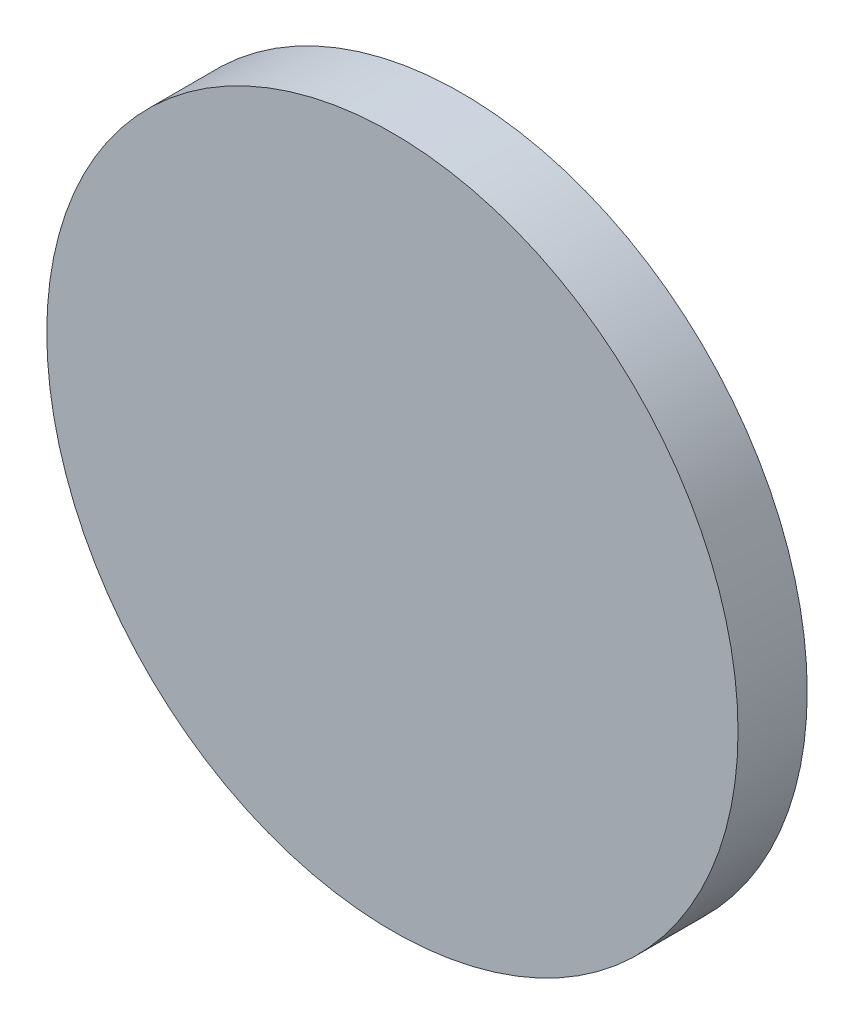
ISO-10303-21;
HEADER;
FILE_DESCRIPTION(('STEP AP214'),'2;1');
FILE_NAME('part.step','',(''),(''),'','','');
FILE_SCHEMA(('AUTOMOTIVE_DESIGN { 1 0 10303 214 1 1 1 1 }'));
ENDSEC;
DATA;
#1=APPLICATION_CONTEXT('core data for automotive mechanical design processes');
#2=APPLICATION_PROTOCOL_DEFINITION('international standard','automotive_design',2000,#1);
#3=PRODUCT_CONTEXT('',#1,'mechanical');
#4=PRODUCT('Part','Part','',(#3));
#5=PRODUCT_RELATED_PRODUCT_CATEGORY('part','',(#4));
#6=PRODUCT_DEFINITION_FORMATION('','',#4);
#7=PRODUCT_DEFINITION_CONTEXT('part definition',#1,'design');
#8=PRODUCT_DEFINITION('design','',#6,#7);
#9=PRODUCT_DEFINITION_SHAPE('','',#8);
#10=(LENGTH_UNIT() NAMED_UNIT(*) SI_UNIT(.MILLI.,.METRE.));
#11=(NAMED_UNIT(*) PLANE_ANGLE_UNIT() SI_UNIT($,.RADIAN.));
#12=(NAMED_UNIT(*) SI_UNIT($,.STERADIAN.) SOLID_ANGLE_UNIT());
#13=UNCERTAINTY_MEASURE_WITH_UNIT(LENGTH_MEASURE(1.E-05),#10,'distance_accuracy_value','');
#14=(GEOMETRIC_REPRESENTATION_CONTEXT(3) GLOBAL_UNCERTAINTY_ASSIGNED_CONTEXT((#13)) GLOBAL_UNIT_ASSIGNED_CONTEXT((#10,
#11,#12)) REPRESENTATION_CONTEXT('',''));
#15=CARTESIAN_POINT('',(0.,0.,0.));
#16=DIRECTION('',(0.,0.,1.));
#17=DIRECTION('',(1.,0.,0.));
#18=AXIS2_PLACEMENT_3D('',#15,#16,#17);
#19=CARTESIAN_POINT('',(-13.8764267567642,74.759707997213,10.));
#20=DIRECTION('',(0.,0.,-1.));
#21=DIRECTION('',(-1.,0.,0.));
#22=AXIS2_PLACEMENT_3D('',#19,#20,#21);
#23=CYLINDRICAL_SURFACE('',#22,49.9486482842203);
#24=CARTESIAN_POINT('',(-13.8764267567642,74.759707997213,10.));
#25=DIRECTION('',(0.,0.,1.));
#26=DIRECTION('',(1.,0.,0.));
#27=AXIS2_PLACEMENT_3D('',#24,#25,#26);
#28=CIRCLE('',#27,49.9486482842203);
#29=CARTESIAN_POINT('',(36.0722215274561,74.759707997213,10.));
#30=VERTEX_POINT('',#29);
#31=EDGE_CURVE('E10',#30,#30,#28,.T.);
#32=ORIENTED_EDGE('',*,*,#31,.F.);
#33=EDGE_LOOP('',(#32));
#34=FACE_BOUND('',#33,.T.);
#35=CARTESIAN_POINT('',(-13.8764267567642,74.759707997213,0.));
#36=DIRECTION('',(0.,0.,1.));
#37=DIRECTION('',(1.,0.,0.));
#38=AXIS2_PLACEMENT_3D('',#35,#36,#37);
#39=CIRCLE('',#38,49.9486482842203);
#40=CARTESIAN_POINT('',(36.0722215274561,74.759707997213,0.));
#41=VERTEX_POINT('',#40);
#42=EDGE_CURVE('E39',#41,#41,#39,.T.);
#43=ORIENTED_EDGE('',*,*,#42,.T.);
#44=EDGE_LOOP('',(#43));
#45=FACE_BOUND('',#44,.T.);
#46=ADVANCED_FACE('F36',(#34,#45),#23,.T.);
#47=CARTESIAN_POINT('',(-13.8764267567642,74.759707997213,10.));
#48=DIRECTION('',(0.,0.,1.));
#49=DIRECTION('',(1.,0.,0.));
#50=AXIS2_PLACEMENT_3D('',#47,#48,#49);
#51=PLANE('',#50);
#52=ORIENTED_EDGE('',*,*,#31,.T.);
#53=EDGE_LOOP('',(#52));
#54=FACE_BOUND('',#53,.T.);
#55=ADVANCED_FACE('F51',(#54),#51,.T.);
#56=CARTESIAN_POINT('',(-13.8764267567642,74.759707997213,0.));
#57=DIRECTION('',(0.,0.,1.));
#58=DIRECTION('',(1.,0.,0.));
#59=AXIS2_PLACEMENT_3D('',#56,#57,#58);
#60=PLANE('',#59);
#61=ORIENTED_EDGE('',*,*,#42,.F.);
#62=EDGE_LOOP('',(#61));
#63=FACE_BOUND('',#62,.T.);
#64=ADVANCED_FACE('F49',(#63),#60,.F.);
#65=CLOSED_SHELL('',(#46,#55,#64));
#66=MANIFOLD_SOLID_BREP('B2',#65);
#67=ADVANCED_BREP_SHAPE_REPRESENTATION('',(#18,#66),#14);
#68=SHAPE_DEFINITION_REPRESENTATION(#9,#67);
ENDSEC;
END-ISO-10303-21;
